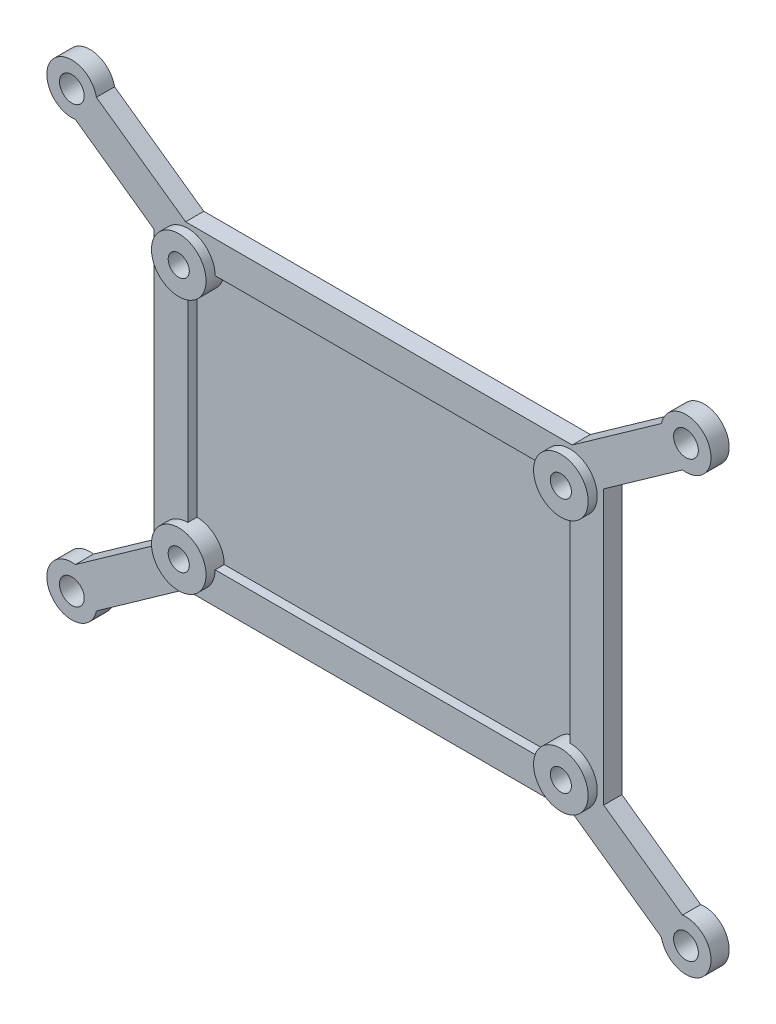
ISO-10303-21;
HEADER;
FILE_DESCRIPTION(('STEP AP214'),'2;1');
FILE_NAME('part.step','',(''),(''),'','','');
FILE_SCHEMA(('AUTOMOTIVE_DESIGN { 1 0 10303 214 1 1 1 1 }'));
ENDSEC;
DATA;
#1=APPLICATION_CONTEXT('core data for automotive mechanical design processes');
#2=APPLICATION_PROTOCOL_DEFINITION('international standard','automotive_design',2000,#1);
#3=PRODUCT_CONTEXT('',#1,'mechanical');
#4=PRODUCT('Part','Part','',(#3));
#5=PRODUCT_RELATED_PRODUCT_CATEGORY('part','',(#4));
#6=PRODUCT_DEFINITION_FORMATION('','',#4);
#7=PRODUCT_DEFINITION_CONTEXT('part definition',#1,'design');
#8=PRODUCT_DEFINITION('design','',#6,#7);
#9=PRODUCT_DEFINITION_SHAPE('','',#8);
#10=(LENGTH_UNIT() NAMED_UNIT(*) SI_UNIT(.MILLI.,.METRE.));
#11=(NAMED_UNIT(*) PLANE_ANGLE_UNIT() SI_UNIT($,.RADIAN.));
#12=(NAMED_UNIT(*) SI_UNIT($,.STERADIAN.) SOLID_ANGLE_UNIT());
#13=UNCERTAINTY_MEASURE_WITH_UNIT(LENGTH_MEASURE(1.E-05),#10,'distance_accuracy_value','');
#14=(GEOMETRIC_REPRESENTATION_CONTEXT(3) GLOBAL_UNCERTAINTY_ASSIGNED_CONTEXT((#13)) GLOBAL_UNIT_ASSIGNED_CONTEXT((#10,
#11,#12)) REPRESENTATION_CONTEXT('',''));
#15=CARTESIAN_POINT('',(0.,0.,0.));
#16=DIRECTION('',(0.,0.,1.));
#17=DIRECTION('',(1.,0.,0.));
#18=AXIS2_PLACEMENT_3D('',#15,#16,#17);
#19=CARTESIAN_POINT('',(-42.8625000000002,30.3625000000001,2.54));
#20=DIRECTION('',(0.,0.,1.));
#21=DIRECTION('',(1.,0.,0.));
#22=AXIS2_PLACEMENT_3D('',#19,#20,#21);
#23=PLANE('',#22);
#24=DIRECTION('',(-1.,0.,0.));
#25=VECTOR('',#24,1.);
#26=CARTESIAN_POINT('',(22.86,17.78,2.54));
#27=LINE('',#26,#25);
#28=CARTESIAN_POINT('',(22.86,17.78,2.54));
#29=VERTEX_POINT('',#28);
#30=CARTESIAN_POINT('',(-22.86,17.78,2.54));
#31=VERTEX_POINT('',#30);
#32=EDGE_CURVE('E393',#29,#31,#27,.T.);
#33=ORIENTED_EDGE('',*,*,#32,.F.);
#34=CARTESIAN_POINT('',(26.67,17.78,2.54));
#35=DIRECTION('',(0.,0.,1.));
#36=DIRECTION('',(1.,0.,0.));
#37=AXIS2_PLACEMENT_3D('',#34,#35,#36);
#38=CIRCLE('',#37,3.81);
#39=CARTESIAN_POINT('',(26.67,13.97,2.54));
#40=VERTEX_POINT('',#39);
#41=EDGE_CURVE('E356',#40,#29,#38,.T.);
#42=ORIENTED_EDGE('',*,*,#41,.F.);
#43=DIRECTION('',(0.,1.,0.));
#44=VECTOR('',#43,1.);
#45=CARTESIAN_POINT('',(26.67,-13.97,2.54));
#46=LINE('',#45,#44);
#47=CARTESIAN_POINT('',(26.67,-13.97,2.54));
#48=VERTEX_POINT('',#47);
#49=EDGE_CURVE('E50',#48,#40,#46,.T.);
#50=ORIENTED_EDGE('',*,*,#49,.F.);
#51=CARTESIAN_POINT('',(26.67,-17.78,2.54));
#52=DIRECTION('',(0.,0.,1.));
#53=DIRECTION('',(1.,0.,0.));
#54=AXIS2_PLACEMENT_3D('',#51,#52,#53);
#55=CIRCLE('',#54,3.81);
#56=CARTESIAN_POINT('',(22.86,-17.78,2.54));
#57=VERTEX_POINT('',#56);
#58=EDGE_CURVE('E350',#57,#48,#55,.T.);
#59=ORIENTED_EDGE('',*,*,#58,.F.);
#60=DIRECTION('',(1.,0.,0.));
#61=VECTOR('',#60,1.);
#62=CARTESIAN_POINT('',(22.86,-17.78,2.54));
#63=LINE('',#62,#61);
#64=CARTESIAN_POINT('',(-22.86,-17.78,2.54));
#65=VERTEX_POINT('',#64);
#66=EDGE_CURVE('E416',#65,#57,#63,.T.);
#67=ORIENTED_EDGE('',*,*,#66,.F.);
#68=CARTESIAN_POINT('',(-26.67,-17.78,2.54));
#69=DIRECTION('',(0.,0.,1.));
#70=DIRECTION('',(1.,0.,0.));
#71=AXIS2_PLACEMENT_3D('',#68,#69,#70);
#72=CIRCLE('',#71,3.81);
#73=CARTESIAN_POINT('',(-26.67,-13.97,2.54));
#74=VERTEX_POINT('',#73);
#75=EDGE_CURVE('E344',#74,#65,#72,.T.);
#76=ORIENTED_EDGE('',*,*,#75,.F.);
#77=DIRECTION('',(0.,-1.,0.));
#78=VECTOR('',#77,1.);
#79=CARTESIAN_POINT('',(-26.67,-13.97,2.54));
#80=LINE('',#79,#78);
#81=CARTESIAN_POINT('',(-26.67,13.97,2.54));
#82=VERTEX_POINT('',#81);
#83=EDGE_CURVE('E419',#82,#74,#80,.T.);
#84=ORIENTED_EDGE('',*,*,#83,.F.);
#85=CARTESIAN_POINT('',(-26.67,17.78,2.54));
#86=DIRECTION('',(0.,0.,1.));
#87=DIRECTION('',(1.,0.,0.));
#88=AXIS2_PLACEMENT_3D('',#85,#86,#87);
#89=CIRCLE('',#88,3.81);
#90=EDGE_CURVE('E338',#31,#82,#89,.T.);
#91=ORIENTED_EDGE('',*,*,#90,.F.);
#92=EDGE_LOOP('',(#33,#42,#50,#59,#67,#76,#84,#91));
#93=FACE_BOUND('',#92,.T.);
#94=CARTESIAN_POINT('',(-42.8625000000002,30.3625000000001,2.54));
#95=DIRECTION('',(0.,0.,1.));
#96=DIRECTION('',(1.,0.,0.));
#97=AXIS2_PLACEMENT_3D('',#94,#95,#96);
#98=CIRCLE('',#97,1.72719999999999);
#99=CARTESIAN_POINT('',(-41.1353000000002,30.3625000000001,2.54));
#100=VERTEX_POINT('',#99);
#101=EDGE_CURVE('E334',#100,#100,#98,.T.);
#102=ORIENTED_EDGE('',*,*,#101,.F.);
#103=EDGE_LOOP('',(#102));
#104=FACE_BOUND('',#103,.T.);
#105=CARTESIAN_POINT('',(42.8624999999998,30.3625000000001,2.54));
#106=DIRECTION('',(0.,0.,1.));
#107=DIRECTION('',(1.,0.,0.));
#108=AXIS2_PLACEMENT_3D('',#105,#106,#107);
#109=CIRCLE('',#108,1.72719999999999);
#110=CARTESIAN_POINT('',(44.5896999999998,30.3625000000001,2.54));
#111=VERTEX_POINT('',#110);
#112=EDGE_CURVE('E328',#111,#111,#109,.T.);
#113=ORIENTED_EDGE('',*,*,#112,.F.);
#114=EDGE_LOOP('',(#113));
#115=FACE_BOUND('',#114,.T.);
#116=CARTESIAN_POINT('',(-42.8625000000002,-30.3624999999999,2.54));
#117=DIRECTION('',(0.,0.,1.));
#118=DIRECTION('',(1.,0.,0.));
#119=AXIS2_PLACEMENT_3D('',#116,#117,#118);
#120=CIRCLE('',#119,1.72719999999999);
#121=CARTESIAN_POINT('',(-41.1353000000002,-30.3624999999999,2.54));
#122=VERTEX_POINT('',#121);
#123=EDGE_CURVE('E322',#122,#122,#120,.T.);
#124=ORIENTED_EDGE('',*,*,#123,.F.);
#125=EDGE_LOOP('',(#124));
#126=FACE_BOUND('',#125,.T.);
#127=CARTESIAN_POINT('',(42.8624999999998,-30.3624999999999,2.54));
#128=DIRECTION('',(0.,0.,1.));
#129=DIRECTION('',(1.,0.,0.));
#130=AXIS2_PLACEMENT_3D('',#127,#128,#129);
#131=CIRCLE('',#130,1.72719999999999);
#132=CARTESIAN_POINT('',(44.5896999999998,-30.3624999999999,2.54));
#133=VERTEX_POINT('',#132);
#134=EDGE_CURVE('E316',#133,#133,#131,.T.);
#135=ORIENTED_EDGE('',*,*,#134,.F.);
#136=EDGE_LOOP('',(#135));
#137=FACE_BOUND('',#136,.T.);
#138=CARTESIAN_POINT('',(-42.8625000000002,30.3625000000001,2.54));
#139=DIRECTION('',(0.,0.,1.));
#140=DIRECTION('',(1.,0.,0.));
#141=AXIS2_PLACEMENT_3D('',#138,#139,#140);
#142=CIRCLE('',#141,3.4925);
#143=CARTESIAN_POINT('',(-39.4382494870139,31.0495696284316,2.54));
#144=VERTEX_POINT('',#143);
#145=CARTESIAN_POINT('',(-42.374678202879,26.9042365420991,2.54));
#146=VERTEX_POINT('',#145);
#147=EDGE_CURVE('E223',#144,#146,#142,.T.);
#148=ORIENTED_EDGE('',*,*,#147,.T.);
#149=DIRECTION('',(0.816010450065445,-0.57803714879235,0.));
#150=VECTOR('',#149,1.);
#151=CARTESIAN_POINT('',(-42.374678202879,26.9042365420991,2.54));
#152=LINE('',#151,#150);
#153=CARTESIAN_POINT('',(-31.374855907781,19.1122947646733,2.54));
#154=VERTEX_POINT('',#153);
#155=EDGE_CURVE('E124',#146,#154,#152,.T.);
#156=ORIENTED_EDGE('',*,*,#155,.T.);
#157=DIRECTION('',(0.,-1.,0.));
#158=VECTOR('',#157,1.);
#159=CARTESIAN_POINT('',(-31.374855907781,-19.1122947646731,2.54));
#160=LINE('',#159,#158);
#161=CARTESIAN_POINT('',(-31.374855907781,-19.1122947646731,2.54));
#162=VERTEX_POINT('',#161);
#163=EDGE_CURVE('E262',#154,#162,#160,.T.);
#164=ORIENTED_EDGE('',*,*,#163,.T.);
#165=DIRECTION('',(-0.816010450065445,-0.57803714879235,0.));
#166=VECTOR('',#165,1.);
#167=CARTESIAN_POINT('',(-31.374855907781,-19.1122947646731,2.54));
#168=LINE('',#167,#166);
#169=CARTESIAN_POINT('',(-42.374678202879,-26.9042365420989,2.54));
#170=VERTEX_POINT('',#169);
#171=EDGE_CURVE('E280',#162,#170,#168,.T.);
#172=ORIENTED_EDGE('',*,*,#171,.T.);
#173=CARTESIAN_POINT('',(-42.8625000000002,-30.3624999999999,2.54));
#174=DIRECTION('',(0.,0.,1.));
#175=DIRECTION('',(1.,0.,0.));
#176=AXIS2_PLACEMENT_3D('',#173,#174,#175);
#177=CIRCLE('',#176,3.4925);
#178=CARTESIAN_POINT('',(-39.4382494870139,-31.0495696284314,2.54));
#179=VERTEX_POINT('',#178);
#180=EDGE_CURVE('E277',#170,#179,#177,.T.);
#181=ORIENTED_EDGE('',*,*,#180,.T.);
#182=DIRECTION('',(0.816010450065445,0.57803714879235,0.));
#183=VECTOR('',#182,1.);
#184=CARTESIAN_POINT('',(-26.9806746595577,-22.225,2.54));
#185=LINE('',#184,#183);
#186=CARTESIAN_POINT('',(-26.9806746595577,-22.225,2.54));
#187=VERTEX_POINT('',#186);
#188=EDGE_CURVE('E279',#179,#187,#185,.T.);
#189=ORIENTED_EDGE('',*,*,#188,.T.);
#190=DIRECTION('',(1.,0.,0.));
#191=VECTOR('',#190,1.);
#192=CARTESIAN_POINT('',(26.9806746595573,-22.225,2.54));
#193=LINE('',#192,#191);
#194=CARTESIAN_POINT('',(26.9806746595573,-22.225,2.54));
#195=VERTEX_POINT('',#194);
#196=EDGE_CURVE('E282',#187,#195,#193,.T.);
#197=ORIENTED_EDGE('',*,*,#196,.T.);
#198=DIRECTION('',(0.816010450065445,-0.57803714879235,0.));
#199=VECTOR('',#198,1.);
#200=CARTESIAN_POINT('',(26.9806746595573,-22.225,2.54));
#201=LINE('',#200,#199);
#202=CARTESIAN_POINT('',(39.4382494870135,-31.0495696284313,2.54));
#203=VERTEX_POINT('',#202);
#204=EDGE_CURVE('E288',#195,#203,#201,.T.);
#205=ORIENTED_EDGE('',*,*,#204,.T.);
#206=CARTESIAN_POINT('',(42.8624999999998,-30.3624999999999,2.54));
#207=DIRECTION('',(0.,0.,1.));
#208=DIRECTION('',(1.,0.,0.));
#209=AXIS2_PLACEMENT_3D('',#206,#207,#208);
#210=CIRCLE('',#209,3.4925);
#211=CARTESIAN_POINT('',(42.3746782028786,-26.9042365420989,2.54));
#212=VERTEX_POINT('',#211);
#213=EDGE_CURVE('E290',#203,#212,#210,.T.);
#214=ORIENTED_EDGE('',*,*,#213,.T.);
#215=DIRECTION('',(-0.816010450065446,0.57803714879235,0.));
#216=VECTOR('',#215,1.);
#217=CARTESIAN_POINT('',(31.374855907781,-19.1122947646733,2.54));
#218=LINE('',#217,#216);
#219=CARTESIAN_POINT('',(31.374855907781,-19.1122947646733,2.54));
#220=VERTEX_POINT('',#219);
#221=EDGE_CURVE('E292',#212,#220,#218,.T.);
#222=ORIENTED_EDGE('',*,*,#221,.T.);
#223=DIRECTION('',(0.,1.,0.));
#224=VECTOR('',#223,1.);
#225=CARTESIAN_POINT('',(31.374855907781,-19.1122947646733,2.54));
#226=LINE('',#225,#224);
#227=CARTESIAN_POINT('',(31.374855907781,19.1122947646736,2.54));
#228=VERTEX_POINT('',#227);
#229=EDGE_CURVE('E294',#220,#228,#226,.T.);
#230=ORIENTED_EDGE('',*,*,#229,.T.);
#231=DIRECTION('',(0.816010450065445,0.57803714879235,0.));
#232=VECTOR('',#231,1.);
#233=CARTESIAN_POINT('',(42.3746782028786,26.9042365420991,2.54));
#234=LINE('',#233,#232);
#235=CARTESIAN_POINT('',(42.3746782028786,26.9042365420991,2.54));
#236=VERTEX_POINT('',#235);
#237=EDGE_CURVE('E296',#228,#236,#234,.T.);
#238=ORIENTED_EDGE('',*,*,#237,.T.);
#239=CARTESIAN_POINT('',(42.8624999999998,30.3625000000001,2.54));
#240=DIRECTION('',(0.,0.,1.));
#241=DIRECTION('',(1.,0.,0.));
#242=AXIS2_PLACEMENT_3D('',#239,#240,#241);
#243=CIRCLE('',#242,3.4925);
#244=CARTESIAN_POINT('',(39.4382494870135,31.0495696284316,2.54));
#245=VERTEX_POINT('',#244);
#246=EDGE_CURVE('E170',#236,#245,#243,.T.);
#247=ORIENTED_EDGE('',*,*,#246,.T.);
#248=DIRECTION('',(-0.816010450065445,-0.57803714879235,0.));
#249=VECTOR('',#248,1.);
#250=CARTESIAN_POINT('',(39.4382494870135,31.0495696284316,2.54));
#251=LINE('',#250,#249);
#252=CARTESIAN_POINT('',(26.980674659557,22.225,2.54));
#253=VERTEX_POINT('',#252);
#254=EDGE_CURVE('E164',#245,#253,#251,.T.);
#255=ORIENTED_EDGE('',*,*,#254,.T.);
#256=DIRECTION('',(-1.,0.,0.));
#257=VECTOR('',#256,1.);
#258=CARTESIAN_POINT('',(26.980674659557,22.225,2.54));
#259=LINE('',#258,#257);
#260=CARTESIAN_POINT('',(-26.9806746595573,22.225,2.54));
#261=VERTEX_POINT('',#260);
#262=EDGE_CURVE('E167',#253,#261,#259,.T.);
#263=ORIENTED_EDGE('',*,*,#262,.T.);
#264=DIRECTION('',(-0.816010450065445,0.57803714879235,0.));
#265=VECTOR('',#264,1.);
#266=CARTESIAN_POINT('',(-39.4382494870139,31.0495696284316,2.54));
#267=LINE('',#266,#265);
#268=EDGE_CURVE('E59',#261,#144,#267,.T.);
#269=ORIENTED_EDGE('',*,*,#268,.T.);
#270=EDGE_LOOP('',(#148,#156,#164,#172,#181,#189,#197,#205,#214,#222,#230,#238,#247,#255,#263,#269));
#271=FACE_BOUND('',#270,.T.);
#272=ADVANCED_FACE('F35',(#93,#104,#115,#126,#137,#271),#23,.T.);
#273=CARTESIAN_POINT('',(-42.8625000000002,30.3625000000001,2.54));
#274=DIRECTION('',(0.,0.,-1.));
#275=DIRECTION('',(-1.,0.,0.));
#276=AXIS2_PLACEMENT_3D('',#273,#274,#275);
#277=CYLINDRICAL_SURFACE('',#276,3.4925);
#278=CARTESIAN_POINT('',(-42.8625000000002,30.3625000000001,0.));
#279=DIRECTION('',(0.,0.,1.));
#280=DIRECTION('',(1.,0.,0.));
#281=AXIS2_PLACEMENT_3D('',#278,#279,#280);
#282=CIRCLE('',#281,3.4925);
#283=CARTESIAN_POINT('',(-39.4382494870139,31.0495696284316,0.));
#284=VERTEX_POINT('',#283);
#285=CARTESIAN_POINT('',(-42.374678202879,26.9042365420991,0.));
#286=VERTEX_POINT('',#285);
#287=EDGE_CURVE('E191',#284,#286,#282,.T.);
#288=ORIENTED_EDGE('',*,*,#287,.T.);
#289=DIRECTION('',(0.,0.,-1.));
#290=VECTOR('',#289,1.);
#291=CARTESIAN_POINT('',(-42.374678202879,26.9042365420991,2.54));
#292=LINE('',#291,#290);
#293=EDGE_CURVE('E12',#146,#286,#292,.T.);
#294=ORIENTED_EDGE('',*,*,#293,.F.);
#295=ORIENTED_EDGE('',*,*,#147,.F.);
#296=DIRECTION('',(0.,0.,-1.));
#297=VECTOR('',#296,1.);
#298=CARTESIAN_POINT('',(-39.4382494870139,31.0495696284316,2.54));
#299=LINE('',#298,#297);
#300=EDGE_CURVE('E187',#144,#284,#299,.T.);
#301=ORIENTED_EDGE('',*,*,#300,.T.);
#302=EDGE_LOOP('',(#288,#294,#295,#301));
#303=FACE_BOUND('',#302,.T.);
#304=ADVANCED_FACE('F37',(#303),#277,.T.);
#305=CARTESIAN_POINT('',(-42.374678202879,26.9042365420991,2.54));
#306=DIRECTION('',(0.57803714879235,0.816010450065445,0.));
#307=DIRECTION('',(-0.816010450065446,0.57803714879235,0.));
#308=AXIS2_PLACEMENT_3D('',#305,#306,#307);
#309=PLANE('',#308);
#310=DIRECTION('',(0.816010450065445,-0.57803714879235,0.));
#311=VECTOR('',#310,1.);
#312=CARTESIAN_POINT('',(-42.374678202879,26.9042365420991,0.));
#313=LINE('',#312,#311);
#314=CARTESIAN_POINT('',(-31.374855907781,19.1122947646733,0.));
#315=VERTEX_POINT('',#314);
#316=EDGE_CURVE('E194',#286,#315,#313,.T.);
#317=ORIENTED_EDGE('',*,*,#316,.T.);
#318=DIRECTION('',(0.,0.,-1.));
#319=VECTOR('',#318,1.);
#320=CARTESIAN_POINT('',(-31.374855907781,19.1122947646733,2.54));
#321=LINE('',#320,#319);
#322=EDGE_CURVE('E43',#154,#315,#321,.T.);
#323=ORIENTED_EDGE('',*,*,#322,.F.);
#324=ORIENTED_EDGE('',*,*,#155,.F.);
#325=ORIENTED_EDGE('',*,*,#293,.T.);
#326=EDGE_LOOP('',(#317,#323,#324,#325));
#327=FACE_BOUND('',#326,.T.);
#328=ADVANCED_FACE('F524',(#327),#309,.F.);
#329=CARTESIAN_POINT('',(-31.374855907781,-19.1122947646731,2.54));
#330=DIRECTION('',(1.,0.,0.));
#331=DIRECTION('',(0.,0.,-1.));
#332=AXIS2_PLACEMENT_3D('',#329,#330,#331);
#333=PLANE('',#332);
#334=DIRECTION('',(0.,-1.,0.));
#335=VECTOR('',#334,1.);
#336=CARTESIAN_POINT('',(-31.374855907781,-19.1122947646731,0.));
#337=LINE('',#336,#335);
#338=CARTESIAN_POINT('',(-31.374855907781,-19.1122947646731,0.));
#339=VERTEX_POINT('',#338);
#340=EDGE_CURVE('E197',#315,#339,#337,.T.);
#341=ORIENTED_EDGE('',*,*,#340,.T.);
#342=DIRECTION('',(0.,0.,-1.));
#343=VECTOR('',#342,1.);
#344=CARTESIAN_POINT('',(-31.374855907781,-19.1122947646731,2.54));
#345=LINE('',#344,#343);
#346=EDGE_CURVE('E254',#162,#339,#345,.T.);
#347=ORIENTED_EDGE('',*,*,#346,.F.);
#348=ORIENTED_EDGE('',*,*,#163,.F.);
#349=ORIENTED_EDGE('',*,*,#322,.T.);
#350=EDGE_LOOP('',(#341,#347,#348,#349));
#351=FACE_BOUND('',#350,.T.);
#352=ADVANCED_FACE('F260',(#351),#333,.F.);
#353=CARTESIAN_POINT('',(-31.374855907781,-19.1122947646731,2.54));
#354=DIRECTION('',(0.57803714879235,-0.816010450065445,0.));
#355=DIRECTION('',(0.816010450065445,0.57803714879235,0.));
#356=AXIS2_PLACEMENT_3D('',#353,#354,#355);
#357=PLANE('',#356);
#358=DIRECTION('',(-0.816010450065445,-0.57803714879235,0.));
#359=VECTOR('',#358,1.);
#360=CARTESIAN_POINT('',(-31.374855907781,-19.1122947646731,0.));
#361=LINE('',#360,#359);
#362=CARTESIAN_POINT('',(-42.374678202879,-26.9042365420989,0.));
#363=VERTEX_POINT('',#362);
#364=EDGE_CURVE('E199',#339,#363,#361,.T.);
#365=ORIENTED_EDGE('',*,*,#364,.T.);
#366=DIRECTION('',(0.,0.,-1.));
#367=VECTOR('',#366,1.);
#368=CARTESIAN_POINT('',(-42.374678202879,-26.9042365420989,2.54));
#369=LINE('',#368,#367);
#370=EDGE_CURVE('E251',#170,#363,#369,.T.);
#371=ORIENTED_EDGE('',*,*,#370,.F.);
#372=ORIENTED_EDGE('',*,*,#171,.F.);
#373=ORIENTED_EDGE('',*,*,#346,.T.);
#374=EDGE_LOOP('',(#365,#371,#372,#373));
#375=FACE_BOUND('',#374,.T.);
#376=ADVANCED_FACE('F271',(#375),#357,.F.);
#377=CARTESIAN_POINT('',(-42.8625000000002,-30.3624999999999,2.54));
#378=DIRECTION('',(0.,0.,-1.));
#379=DIRECTION('',(-1.,0.,0.));
#380=AXIS2_PLACEMENT_3D('',#377,#378,#379);
#381=CYLINDRICAL_SURFACE('',#380,3.4925);
#382=CARTESIAN_POINT('',(-42.8625000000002,-30.3624999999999,0.));
#383=DIRECTION('',(0.,0.,1.));
#384=DIRECTION('',(1.,0.,0.));
#385=AXIS2_PLACEMENT_3D('',#382,#383,#384);
#386=CIRCLE('',#385,3.4925);
#387=CARTESIAN_POINT('',(-39.4382494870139,-31.0495696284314,0.));
#388=VERTEX_POINT('',#387);
#389=EDGE_CURVE('E201',#363,#388,#386,.T.);
#390=ORIENTED_EDGE('',*,*,#389,.T.);
#391=DIRECTION('',(0.,0.,-1.));
#392=VECTOR('',#391,1.);
#393=CARTESIAN_POINT('',(-39.4382494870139,-31.0495696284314,2.54));
#394=LINE('',#393,#392);
#395=EDGE_CURVE('E248',#179,#388,#394,.T.);
#396=ORIENTED_EDGE('',*,*,#395,.F.);
#397=ORIENTED_EDGE('',*,*,#180,.F.);
#398=ORIENTED_EDGE('',*,*,#370,.T.);
#399=EDGE_LOOP('',(#390,#396,#397,#398));
#400=FACE_BOUND('',#399,.T.);
#401=ADVANCED_FACE('F275',(#400),#381,.T.);
#402=CARTESIAN_POINT('',(-26.9806746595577,-22.225,2.54));
#403=DIRECTION('',(-0.57803714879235,0.816010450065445,0.));
#404=DIRECTION('',(-0.816010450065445,-0.57803714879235,0.));
#405=AXIS2_PLACEMENT_3D('',#402,#403,#404);
#406=PLANE('',#405);
#407=DIRECTION('',(0.816010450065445,0.57803714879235,0.));
#408=VECTOR('',#407,1.);
#409=CARTESIAN_POINT('',(-26.9806746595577,-22.225,0.));
#410=LINE('',#409,#408);
#411=CARTESIAN_POINT('',(-26.9806746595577,-22.225,0.));
#412=VERTEX_POINT('',#411);
#413=EDGE_CURVE('E203',#388,#412,#410,.T.);
#414=ORIENTED_EDGE('',*,*,#413,.T.);
#415=DIRECTION('',(0.,0.,-1.));
#416=VECTOR('',#415,1.);
#417=CARTESIAN_POINT('',(-26.9806746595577,-22.225,2.54));
#418=LINE('',#417,#416);
#419=EDGE_CURVE('E245',#187,#412,#418,.T.);
#420=ORIENTED_EDGE('',*,*,#419,.F.);
#421=ORIENTED_EDGE('',*,*,#188,.F.);
#422=ORIENTED_EDGE('',*,*,#395,.T.);
#423=EDGE_LOOP('',(#414,#420,#421,#422));
#424=FACE_BOUND('',#423,.T.);
#425=ADVANCED_FACE('F561',(#424),#406,.F.);
#426=CARTESIAN_POINT('',(26.9806746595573,-22.225,2.54));
#427=DIRECTION('',(0.,1.,0.));
#428=DIRECTION('',(0.,0.,1.));
#429=AXIS2_PLACEMENT_3D('',#426,#427,#428);
#430=PLANE('',#429);
#431=DIRECTION('',(1.,0.,0.));
#432=VECTOR('',#431,1.);
#433=CARTESIAN_POINT('',(26.9806746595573,-22.225,0.));
#434=LINE('',#433,#432);
#435=CARTESIAN_POINT('',(26.9806746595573,-22.225,0.));
#436=VERTEX_POINT('',#435);
#437=EDGE_CURVE('E205',#412,#436,#434,.T.);
#438=ORIENTED_EDGE('',*,*,#437,.T.);
#439=DIRECTION('',(0.,0.,-1.));
#440=VECTOR('',#439,1.);
#441=CARTESIAN_POINT('',(26.9806746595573,-22.225,2.54));
#442=LINE('',#441,#440);
#443=EDGE_CURVE('E242',#195,#436,#442,.T.);
#444=ORIENTED_EDGE('',*,*,#443,.F.);
#445=ORIENTED_EDGE('',*,*,#196,.F.);
#446=ORIENTED_EDGE('',*,*,#419,.T.);
#447=EDGE_LOOP('',(#438,#444,#445,#446));
#448=FACE_BOUND('',#447,.T.);
#449=ADVANCED_FACE('F557',(#448),#430,.F.);
#450=CARTESIAN_POINT('',(26.9806746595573,-22.225,2.54));
#451=DIRECTION('',(0.57803714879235,0.816010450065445,0.));
#452=DIRECTION('',(-0.816010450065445,0.57803714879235,0.));
#453=AXIS2_PLACEMENT_3D('',#450,#451,#452);
#454=PLANE('',#453);
#455=DIRECTION('',(0.816010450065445,-0.57803714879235,0.));
#456=VECTOR('',#455,1.);
#457=CARTESIAN_POINT('',(26.9806746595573,-22.225,0.));
#458=LINE('',#457,#456);
#459=CARTESIAN_POINT('',(39.4382494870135,-31.0495696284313,0.));
#460=VERTEX_POINT('',#459);
#461=EDGE_CURVE('E207',#436,#460,#458,.T.);
#462=ORIENTED_EDGE('',*,*,#461,.T.);
#463=DIRECTION('',(0.,0.,-1.));
#464=VECTOR('',#463,1.);
#465=CARTESIAN_POINT('',(39.4382494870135,-31.0495696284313,2.54));
#466=LINE('',#465,#464);
#467=EDGE_CURVE('E239',#203,#460,#466,.T.);
#468=ORIENTED_EDGE('',*,*,#467,.F.);
#469=ORIENTED_EDGE('',*,*,#204,.F.);
#470=ORIENTED_EDGE('',*,*,#443,.T.);
#471=EDGE_LOOP('',(#462,#468,#469,#470));
#472=FACE_BOUND('',#471,.T.);
#473=ADVANCED_FACE('F553',(#472),#454,.F.);
#474=CARTESIAN_POINT('',(42.8624999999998,-30.3624999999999,2.54));
#475=DIRECTION('',(0.,0.,-1.));
#476=DIRECTION('',(-1.,0.,0.));
#477=AXIS2_PLACEMENT_3D('',#474,#475,#476);
#478=CYLINDRICAL_SURFACE('',#477,3.4925);
#479=CARTESIAN_POINT('',(42.8624999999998,-30.3624999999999,0.));
#480=DIRECTION('',(0.,0.,1.));
#481=DIRECTION('',(1.,0.,0.));
#482=AXIS2_PLACEMENT_3D('',#479,#480,#481);
#483=CIRCLE('',#482,3.4925);
#484=CARTESIAN_POINT('',(42.3746782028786,-26.9042365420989,0.));
#485=VERTEX_POINT('',#484);
#486=EDGE_CURVE('E209',#460,#485,#483,.T.);
#487=ORIENTED_EDGE('',*,*,#486,.T.);
#488=DIRECTION('',(0.,0.,-1.));
#489=VECTOR('',#488,1.);
#490=CARTESIAN_POINT('',(42.3746782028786,-26.9042365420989,2.54));
#491=LINE('',#490,#489);
#492=EDGE_CURVE('E236',#212,#485,#491,.T.);
#493=ORIENTED_EDGE('',*,*,#492,.F.);
#494=ORIENTED_EDGE('',*,*,#213,.F.);
#495=ORIENTED_EDGE('',*,*,#467,.T.);
#496=EDGE_LOOP('',(#487,#493,#494,#495));
#497=FACE_BOUND('',#496,.T.);
#498=ADVANCED_FACE('F549',(#497),#478,.T.);
#499=CARTESIAN_POINT('',(31.374855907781,-19.1122947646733,2.54));
#500=DIRECTION('',(-0.57803714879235,-0.816010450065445,0.));
#501=DIRECTION('',(0.816010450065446,-0.57803714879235,0.));
#502=AXIS2_PLACEMENT_3D('',#499,#500,#501);
#503=PLANE('',#502);
#504=DIRECTION('',(-0.816010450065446,0.57803714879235,0.));
#505=VECTOR('',#504,1.);
#506=CARTESIAN_POINT('',(31.374855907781,-19.1122947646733,0.));
#507=LINE('',#506,#505);
#508=CARTESIAN_POINT('',(31.374855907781,-19.1122947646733,0.));
#509=VERTEX_POINT('',#508);
#510=EDGE_CURVE('E211',#485,#509,#507,.T.);
#511=ORIENTED_EDGE('',*,*,#510,.T.);
#512=DIRECTION('',(0.,0.,-1.));
#513=VECTOR('',#512,1.);
#514=CARTESIAN_POINT('',(31.374855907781,-19.1122947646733,2.54));
#515=LINE('',#514,#513);
#516=EDGE_CURVE('E233',#220,#509,#515,.T.);
#517=ORIENTED_EDGE('',*,*,#516,.F.);
#518=ORIENTED_EDGE('',*,*,#221,.F.);
#519=ORIENTED_EDGE('',*,*,#492,.T.);
#520=EDGE_LOOP('',(#511,#517,#518,#519));
#521=FACE_BOUND('',#520,.T.);
#522=ADVANCED_FACE('F545',(#521),#503,.F.);
#523=CARTESIAN_POINT('',(31.374855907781,-19.1122947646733,2.54));
#524=DIRECTION('',(-1.,0.,0.));
#525=DIRECTION('',(0.,0.,1.));
#526=AXIS2_PLACEMENT_3D('',#523,#524,#525);
#527=PLANE('',#526);
#528=DIRECTION('',(0.,1.,0.));
#529=VECTOR('',#528,1.);
#530=CARTESIAN_POINT('',(31.374855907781,-19.1122947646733,0.));
#531=LINE('',#530,#529);
#532=CARTESIAN_POINT('',(31.374855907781,19.1122947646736,0.));
#533=VERTEX_POINT('',#532);
#534=EDGE_CURVE('E213',#509,#533,#531,.T.);
#535=ORIENTED_EDGE('',*,*,#534,.T.);
#536=DIRECTION('',(0.,0.,-1.));
#537=VECTOR('',#536,1.);
#538=CARTESIAN_POINT('',(31.374855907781,19.1122947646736,2.54));
#539=LINE('',#538,#537);
#540=EDGE_CURVE('E230',#228,#533,#539,.T.);
#541=ORIENTED_EDGE('',*,*,#540,.F.);
#542=ORIENTED_EDGE('',*,*,#229,.F.);
#543=ORIENTED_EDGE('',*,*,#516,.T.);
#544=EDGE_LOOP('',(#535,#541,#542,#543));
#545=FACE_BOUND('',#544,.T.);
#546=ADVANCED_FACE('F542',(#545),#527,.F.);
#547=CARTESIAN_POINT('',(42.3746782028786,26.9042365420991,2.54));
#548=DIRECTION('',(-0.57803714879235,0.816010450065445,0.));
#549=DIRECTION('',(-0.816010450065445,-0.57803714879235,0.));
#550=AXIS2_PLACEMENT_3D('',#547,#548,#549);
#551=PLANE('',#550);
#552=DIRECTION('',(0.816010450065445,0.57803714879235,0.));
#553=VECTOR('',#552,1.);
#554=CARTESIAN_POINT('',(42.3746782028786,26.9042365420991,0.));
#555=LINE('',#554,#553);
#556=CARTESIAN_POINT('',(42.3746782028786,26.9042365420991,0.));
#557=VERTEX_POINT('',#556);
#558=EDGE_CURVE('E215',#533,#557,#555,.T.);
#559=ORIENTED_EDGE('',*,*,#558,.T.);
#560=DIRECTION('',(0.,0.,-1.));
#561=VECTOR('',#560,1.);
#562=CARTESIAN_POINT('',(42.3746782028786,26.9042365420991,2.54));
#563=LINE('',#562,#561);
#564=EDGE_CURVE('E227',#236,#557,#563,.T.);
#565=ORIENTED_EDGE('',*,*,#564,.F.);
#566=ORIENTED_EDGE('',*,*,#237,.F.);
#567=ORIENTED_EDGE('',*,*,#540,.T.);
#568=EDGE_LOOP('',(#559,#565,#566,#567));
#569=FACE_BOUND('',#568,.T.);
#570=ADVANCED_FACE('F302',(#569),#551,.F.);
#571=CARTESIAN_POINT('',(42.8624999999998,30.3625000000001,2.54));
#572=DIRECTION('',(0.,0.,-1.));
#573=DIRECTION('',(-1.,0.,0.));
#574=AXIS2_PLACEMENT_3D('',#571,#572,#573);
#575=CYLINDRICAL_SURFACE('',#574,3.4925);
#576=CARTESIAN_POINT('',(42.8624999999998,30.3625000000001,0.));
#577=DIRECTION('',(0.,0.,1.));
#578=DIRECTION('',(1.,0.,0.));
#579=AXIS2_PLACEMENT_3D('',#576,#577,#578);
#580=CIRCLE('',#579,3.4925);
#581=CARTESIAN_POINT('',(39.4382494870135,31.0495696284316,0.));
#582=VERTEX_POINT('',#581);
#583=EDGE_CURVE('E217',#557,#582,#580,.T.);
#584=ORIENTED_EDGE('',*,*,#583,.T.);
#585=DIRECTION('',(0.,0.,-1.));
#586=VECTOR('',#585,1.);
#587=CARTESIAN_POINT('',(39.4382494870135,31.0495696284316,2.54));
#588=LINE('',#587,#586);
#589=EDGE_CURVE('E182',#245,#582,#588,.T.);
#590=ORIENTED_EDGE('',*,*,#589,.F.);
#591=ORIENTED_EDGE('',*,*,#246,.F.);
#592=ORIENTED_EDGE('',*,*,#564,.T.);
#593=EDGE_LOOP('',(#584,#590,#591,#592));
#594=FACE_BOUND('',#593,.T.);
#595=ADVANCED_FACE('F306',(#594),#575,.T.);
#596=CARTESIAN_POINT('',(39.4382494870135,31.0495696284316,2.54));
#597=DIRECTION('',(0.57803714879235,-0.816010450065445,0.));
#598=DIRECTION('',(0.816010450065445,0.57803714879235,0.));
#599=AXIS2_PLACEMENT_3D('',#596,#597,#598);
#600=PLANE('',#599);
#601=DIRECTION('',(-0.816010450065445,-0.57803714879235,0.));
#602=VECTOR('',#601,1.);
#603=CARTESIAN_POINT('',(39.4382494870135,31.0495696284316,0.));
#604=LINE('',#603,#602);
#605=CARTESIAN_POINT('',(26.980674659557,22.225,0.));
#606=VERTEX_POINT('',#605);
#607=EDGE_CURVE('E179',#582,#606,#604,.T.);
#608=ORIENTED_EDGE('',*,*,#607,.T.);
#609=DIRECTION('',(0.,0.,-1.));
#610=VECTOR('',#609,1.);
#611=CARTESIAN_POINT('',(26.980674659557,22.225,2.54));
#612=LINE('',#611,#610);
#613=EDGE_CURVE('E176',#253,#606,#612,.T.);
#614=ORIENTED_EDGE('',*,*,#613,.F.);
#615=ORIENTED_EDGE('',*,*,#254,.F.);
#616=ORIENTED_EDGE('',*,*,#589,.T.);
#617=EDGE_LOOP('',(#608,#614,#615,#616));
#618=FACE_BOUND('',#617,.T.);
#619=ADVANCED_FACE('F177',(#618),#600,.F.);
#620=CARTESIAN_POINT('',(26.980674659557,22.225,2.54));
#621=DIRECTION('',(0.,-1.,0.));
#622=DIRECTION('',(0.,0.,-1.));
#623=AXIS2_PLACEMENT_3D('',#620,#621,#622);
#624=PLANE('',#623);
#625=DIRECTION('',(-1.,0.,0.));
#626=VECTOR('',#625,1.);
#627=CARTESIAN_POINT('',(26.980674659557,22.225,0.));
#628=LINE('',#627,#626);
#629=CARTESIAN_POINT('',(-26.9806746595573,22.225,0.));
#630=VERTEX_POINT('',#629);
#631=EDGE_CURVE('E220',#606,#630,#628,.T.);
#632=ORIENTED_EDGE('',*,*,#631,.T.);
#633=DIRECTION('',(0.,0.,-1.));
#634=VECTOR('',#633,1.);
#635=CARTESIAN_POINT('',(-26.9806746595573,22.225,2.54));
#636=LINE('',#635,#634);
#637=EDGE_CURVE('E183',#261,#630,#636,.T.);
#638=ORIENTED_EDGE('',*,*,#637,.F.);
#639=ORIENTED_EDGE('',*,*,#262,.F.);
#640=ORIENTED_EDGE('',*,*,#613,.T.);
#641=EDGE_LOOP('',(#632,#638,#639,#640));
#642=FACE_BOUND('',#641,.T.);
#643=ADVANCED_FACE('F185',(#642),#624,.F.);
#644=CARTESIAN_POINT('',(-39.4382494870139,31.0495696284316,2.54));
#645=DIRECTION('',(-0.57803714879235,-0.816010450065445,0.));
#646=DIRECTION('',(0.816010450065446,-0.57803714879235,0.));
#647=AXIS2_PLACEMENT_3D('',#644,#645,#646);
#648=PLANE('',#647);
#649=DIRECTION('',(-0.816010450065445,0.57803714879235,0.));
#650=VECTOR('',#649,1.);
#651=CARTESIAN_POINT('',(-39.4382494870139,31.0495696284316,0.));
#652=LINE('',#651,#650);
#653=EDGE_CURVE('E116',#630,#284,#652,.T.);
#654=ORIENTED_EDGE('',*,*,#653,.T.);
#655=ORIENTED_EDGE('',*,*,#300,.F.);
#656=ORIENTED_EDGE('',*,*,#268,.F.);
#657=ORIENTED_EDGE('',*,*,#637,.T.);
#658=EDGE_LOOP('',(#654,#655,#656,#657));
#659=FACE_BOUND('',#658,.T.);
#660=ADVANCED_FACE('F307',(#659),#648,.F.);
#661=CARTESIAN_POINT('',(-42.8625000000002,30.3625000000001,0.));
#662=DIRECTION('',(0.,0.,1.));
#663=DIRECTION('',(1.,0.,0.));
#664=AXIS2_PLACEMENT_3D('',#661,#662,#663);
#665=PLANE('',#664);
#666=CARTESIAN_POINT('',(-26.67,17.78,0.));
#667=DIRECTION('',(0.,0.,1.));
#668=DIRECTION('',(1.,0.,0.));
#669=AXIS2_PLACEMENT_3D('',#666,#667,#668);
#670=CIRCLE('',#669,1.4732);
#671=CARTESIAN_POINT('',(-25.1968,17.78,0.));
#672=VERTEX_POINT('',#671);
#673=EDGE_CURVE('E379',#672,#672,#670,.T.);
#674=ORIENTED_EDGE('',*,*,#673,.T.);
#675=EDGE_LOOP('',(#674));
#676=FACE_BOUND('',#675,.T.);
#677=CARTESIAN_POINT('',(-26.67,-17.78,0.));
#678=DIRECTION('',(0.,0.,1.));
#679=DIRECTION('',(1.,0.,0.));
#680=AXIS2_PLACEMENT_3D('',#677,#678,#679);
#681=CIRCLE('',#680,1.4732);
#682=CARTESIAN_POINT('',(-25.1968,-17.78,0.));
#683=VERTEX_POINT('',#682);
#684=EDGE_CURVE('E373',#683,#683,#681,.T.);
#685=ORIENTED_EDGE('',*,*,#684,.T.);
#686=EDGE_LOOP('',(#685));
#687=FACE_BOUND('',#686,.T.);
#688=CARTESIAN_POINT('',(26.67,17.78,0.));
#689=DIRECTION('',(0.,0.,1.));
#690=DIRECTION('',(1.,0.,0.));
#691=AXIS2_PLACEMENT_3D('',#688,#689,#690);
#692=CIRCLE('',#691,1.4732);
#693=CARTESIAN_POINT('',(28.1432,17.78,0.));
#694=VERTEX_POINT('',#693);
#695=EDGE_CURVE('E367',#694,#694,#692,.T.);
#696=ORIENTED_EDGE('',*,*,#695,.T.);
#697=EDGE_LOOP('',(#696));
#698=FACE_BOUND('',#697,.T.);
#699=CARTESIAN_POINT('',(26.67,-17.78,0.));
#700=DIRECTION('',(0.,0.,1.));
#701=DIRECTION('',(1.,0.,0.));
#702=AXIS2_PLACEMENT_3D('',#699,#700,#701);
#703=CIRCLE('',#702,1.4732);
#704=CARTESIAN_POINT('',(28.1432,-17.78,0.));
#705=VERTEX_POINT('',#704);
#706=EDGE_CURVE('E359',#705,#705,#703,.T.);
#707=ORIENTED_EDGE('',*,*,#706,.T.);
#708=EDGE_LOOP('',(#707));
#709=FACE_BOUND('',#708,.T.);
#710=CARTESIAN_POINT('',(-42.8625000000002,30.3625000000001,0.));
#711=DIRECTION('',(0.,0.,1.));
#712=DIRECTION('',(1.,0.,0.));
#713=AXIS2_PLACEMENT_3D('',#710,#711,#712);
#714=CIRCLE('',#713,1.72719999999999);
#715=CARTESIAN_POINT('',(-41.1353000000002,30.3625000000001,0.));
#716=VERTEX_POINT('',#715);
#717=EDGE_CURVE('E331',#716,#716,#714,.T.);
#718=ORIENTED_EDGE('',*,*,#717,.T.);
#719=EDGE_LOOP('',(#718));
#720=FACE_BOUND('',#719,.T.);
#721=CARTESIAN_POINT('',(42.8624999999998,30.3625000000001,0.));
#722=DIRECTION('',(0.,0.,1.));
#723=DIRECTION('',(1.,0.,0.));
#724=AXIS2_PLACEMENT_3D('',#721,#722,#723);
#725=CIRCLE('',#724,1.72719999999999);
#726=CARTESIAN_POINT('',(44.5896999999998,30.3625000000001,0.));
#727=VERTEX_POINT('',#726);
#728=EDGE_CURVE('E325',#727,#727,#725,.T.);
#729=ORIENTED_EDGE('',*,*,#728,.T.);
#730=EDGE_LOOP('',(#729));
#731=FACE_BOUND('',#730,.T.);
#732=CARTESIAN_POINT('',(-42.8625000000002,-30.3624999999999,0.));
#733=DIRECTION('',(0.,0.,1.));
#734=DIRECTION('',(1.,0.,0.));
#735=AXIS2_PLACEMENT_3D('',#732,#733,#734);
#736=CIRCLE('',#735,1.72719999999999);
#737=CARTESIAN_POINT('',(-41.1353000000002,-30.3624999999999,0.));
#738=VERTEX_POINT('',#737);
#739=EDGE_CURVE('E319',#738,#738,#736,.T.);
#740=ORIENTED_EDGE('',*,*,#739,.T.);
#741=EDGE_LOOP('',(#740));
#742=FACE_BOUND('',#741,.T.);
#743=CARTESIAN_POINT('',(42.8624999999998,-30.3624999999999,0.));
#744=DIRECTION('',(0.,0.,1.));
#745=DIRECTION('',(1.,0.,0.));
#746=AXIS2_PLACEMENT_3D('',#743,#744,#745);
#747=CIRCLE('',#746,1.72719999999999);
#748=CARTESIAN_POINT('',(44.5896999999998,-30.3624999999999,0.));
#749=VERTEX_POINT('',#748);
#750=EDGE_CURVE('E195',#749,#749,#747,.T.);
#751=ORIENTED_EDGE('',*,*,#750,.T.);
#752=EDGE_LOOP('',(#751));
#753=FACE_BOUND('',#752,.T.);
#754=ORIENTED_EDGE('',*,*,#287,.F.);
#755=ORIENTED_EDGE('',*,*,#653,.F.);
#756=ORIENTED_EDGE('',*,*,#631,.F.);
#757=ORIENTED_EDGE('',*,*,#607,.F.);
#758=ORIENTED_EDGE('',*,*,#583,.F.);
#759=ORIENTED_EDGE('',*,*,#558,.F.);
#760=ORIENTED_EDGE('',*,*,#534,.F.);
#761=ORIENTED_EDGE('',*,*,#510,.F.);
#762=ORIENTED_EDGE('',*,*,#486,.F.);
#763=ORIENTED_EDGE('',*,*,#461,.F.);
#764=ORIENTED_EDGE('',*,*,#437,.F.);
#765=ORIENTED_EDGE('',*,*,#413,.F.);
#766=ORIENTED_EDGE('',*,*,#389,.F.);
#767=ORIENTED_EDGE('',*,*,#364,.F.);
#768=ORIENTED_EDGE('',*,*,#340,.F.);
#769=ORIENTED_EDGE('',*,*,#316,.F.);
#770=EDGE_LOOP('',(#754,#755,#756,#757,#758,#759,#760,#761,#762,#763,#764,#765,#766,#767,#768,#769));
#771=FACE_BOUND('',#770,.T.);
#772=ADVANCED_FACE('F266',(#676,#687,#698,#709,#720,#731,#742,#753,#771),#665,.F.);
#773=CARTESIAN_POINT('',(42.8624999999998,-30.3624999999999,2.54));
#774=DIRECTION('',(0.,0.,1.));
#775=DIRECTION('',(1.,0.,0.));
#776=AXIS2_PLACEMENT_3D('',#773,#774,#775);
#777=CYLINDRICAL_SURFACE('',#776,1.72719999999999);
#778=ORIENTED_EDGE('',*,*,#134,.T.);
#779=EDGE_LOOP('',(#778));
#780=FACE_BOUND('',#779,.T.);
#781=ORIENTED_EDGE('',*,*,#750,.F.);
#782=EDGE_LOOP('',(#781));
#783=FACE_BOUND('',#782,.T.);
#784=ADVANCED_FACE('F527',(#780,#783),#777,.F.);
#785=CARTESIAN_POINT('',(-42.8625000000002,-30.3624999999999,2.54));
#786=DIRECTION('',(0.,0.,1.));
#787=DIRECTION('',(1.,0.,0.));
#788=AXIS2_PLACEMENT_3D('',#785,#786,#787);
#789=CYLINDRICAL_SURFACE('',#788,1.72719999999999);
#790=ORIENTED_EDGE('',*,*,#123,.T.);
#791=EDGE_LOOP('',(#790));
#792=FACE_BOUND('',#791,.T.);
#793=ORIENTED_EDGE('',*,*,#739,.F.);
#794=EDGE_LOOP('',(#793));
#795=FACE_BOUND('',#794,.T.);
#796=ADVANCED_FACE('F644',(#792,#795),#789,.F.);
#797=CARTESIAN_POINT('',(42.8624999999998,30.3625000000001,2.54));
#798=DIRECTION('',(0.,0.,1.));
#799=DIRECTION('',(1.,0.,0.));
#800=AXIS2_PLACEMENT_3D('',#797,#798,#799);
#801=CYLINDRICAL_SURFACE('',#800,1.72719999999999);
#802=ORIENTED_EDGE('',*,*,#112,.T.);
#803=EDGE_LOOP('',(#802));
#804=FACE_BOUND('',#803,.T.);
#805=ORIENTED_EDGE('',*,*,#728,.F.);
#806=EDGE_LOOP('',(#805));
#807=FACE_BOUND('',#806,.T.);
#808=ADVANCED_FACE('F651',(#804,#807),#801,.F.);
#809=CARTESIAN_POINT('',(-42.8625000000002,30.3625000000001,2.54));
#810=DIRECTION('',(0.,0.,1.));
#811=DIRECTION('',(1.,0.,0.));
#812=AXIS2_PLACEMENT_3D('',#809,#810,#811);
#813=CYLINDRICAL_SURFACE('',#812,1.72719999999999);
#814=ORIENTED_EDGE('',*,*,#101,.T.);
#815=EDGE_LOOP('',(#814));
#816=FACE_BOUND('',#815,.T.);
#817=ORIENTED_EDGE('',*,*,#717,.F.);
#818=EDGE_LOOP('',(#817));
#819=FACE_BOUND('',#818,.T.);
#820=ADVANCED_FACE('F658',(#816,#819),#813,.F.);
#821=CARTESIAN_POINT('',(-26.67,17.78,3.81));
#822=DIRECTION('',(0.,0.,-1.));
#823=DIRECTION('',(-1.,0.,0.));
#824=AXIS2_PLACEMENT_3D('',#821,#822,#823);
#825=CYLINDRICAL_SURFACE('',#824,3.81);
#826=CARTESIAN_POINT('',(-26.67,17.78,3.81));
#827=DIRECTION('',(0.,0.,1.));
#828=DIRECTION('',(1.,0.,0.));
#829=AXIS2_PLACEMENT_3D('',#826,#827,#828);
#830=CIRCLE('',#829,3.81);
#831=CARTESIAN_POINT('',(-22.86,17.78,3.81));
#832=VERTEX_POINT('',#831);
#833=EDGE_CURVE('E337',#832,#832,#830,.T.);
#834=ORIENTED_EDGE('',*,*,#833,.F.);
#835=EDGE_LOOP('',(#834));
#836=FACE_BOUND('',#835,.T.);
#837=ORIENTED_EDGE('',*,*,#90,.T.);
#838=DIRECTION('',(0.,0.,1.));
#839=VECTOR('',#838,1.);
#840=CARTESIAN_POINT('',(-26.67,13.97,-64.1067016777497));
#841=LINE('',#840,#839);
#842=CARTESIAN_POINT('',(-26.67,13.97,1.26999999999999));
#843=VERTEX_POINT('',#842);
#844=EDGE_CURVE('E389',#843,#82,#841,.T.);
#845=ORIENTED_EDGE('',*,*,#844,.F.);
#846=CARTESIAN_POINT('',(-26.67,17.78,1.26999999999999));
#847=DIRECTION('',(0.,0.,1.));
#848=DIRECTION('',(1.,0.,0.));
#849=AXIS2_PLACEMENT_3D('',#846,#847,#848);
#850=CIRCLE('',#849,3.81);
#851=CARTESIAN_POINT('',(-22.86,17.78,1.26999999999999));
#852=VERTEX_POINT('',#851);
#853=EDGE_CURVE('E388',#843,#852,#850,.T.);
#854=ORIENTED_EDGE('',*,*,#853,.T.);
#855=DIRECTION('',(0.,0.,1.));
#856=VECTOR('',#855,1.);
#857=CARTESIAN_POINT('',(-22.86,17.78,-64.1067016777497));
#858=LINE('',#857,#856);
#859=EDGE_CURVE('E409',#852,#31,#858,.T.);
#860=ORIENTED_EDGE('',*,*,#859,.T.);
#861=EDGE_LOOP('',(#837,#845,#854,#860));
#862=FACE_BOUND('',#861,.T.);
#863=ADVANCED_FACE('F465',(#836,#862),#825,.T.);
#864=CARTESIAN_POINT('',(-26.67,17.78,3.81));
#865=DIRECTION('',(0.,0.,1.));
#866=DIRECTION('',(1.,0.,0.));
#867=AXIS2_PLACEMENT_3D('',#864,#865,#866);
#868=PLANE('',#867);
#869=CARTESIAN_POINT('',(-26.67,17.78,3.81));
#870=DIRECTION('',(0.,0.,1.));
#871=DIRECTION('',(1.,0.,0.));
#872=AXIS2_PLACEMENT_3D('',#869,#870,#871);
#873=CIRCLE('',#872,1.47319999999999);
#874=CARTESIAN_POINT('',(-25.1968,17.78,3.81));
#875=VERTEX_POINT('',#874);
#876=EDGE_CURVE('E382',#875,#875,#873,.T.);
#877=ORIENTED_EDGE('',*,*,#876,.F.);
#878=EDGE_LOOP('',(#877));
#879=FACE_BOUND('',#878,.T.);
#880=ORIENTED_EDGE('',*,*,#833,.T.);
#881=EDGE_LOOP('',(#880));
#882=FACE_BOUND('',#881,.T.);
#883=ADVANCED_FACE('F672',(#879,#882),#868,.T.);
#884=CARTESIAN_POINT('',(-26.67,-17.78,3.81));
#885=DIRECTION('',(0.,0.,-1.));
#886=DIRECTION('',(-1.,0.,0.));
#887=AXIS2_PLACEMENT_3D('',#884,#885,#886);
#888=CYLINDRICAL_SURFACE('',#887,3.81);
#889=CARTESIAN_POINT('',(-26.67,-17.78,3.81));
#890=DIRECTION('',(0.,0.,1.));
#891=DIRECTION('',(1.,0.,0.));
#892=AXIS2_PLACEMENT_3D('',#889,#890,#891);
#893=CIRCLE('',#892,3.81);
#894=CARTESIAN_POINT('',(-22.86,-17.78,3.81));
#895=VERTEX_POINT('',#894);
#896=EDGE_CURVE('E341',#895,#895,#893,.T.);
#897=ORIENTED_EDGE('',*,*,#896,.F.);
#898=EDGE_LOOP('',(#897));
#899=FACE_BOUND('',#898,.T.);
#900=ORIENTED_EDGE('',*,*,#75,.T.);
#901=DIRECTION('',(0.,0.,1.));
#902=VECTOR('',#901,1.);
#903=CARTESIAN_POINT('',(-22.86,-17.78,-64.1067016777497));
#904=LINE('',#903,#902);
#905=CARTESIAN_POINT('',(-22.86,-17.78,1.26999999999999));
#906=VERTEX_POINT('',#905);
#907=EDGE_CURVE('E396',#906,#65,#904,.T.);
#908=ORIENTED_EDGE('',*,*,#907,.F.);
#909=CARTESIAN_POINT('',(-26.67,-17.78,1.26999999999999));
#910=DIRECTION('',(0.,0.,1.));
#911=DIRECTION('',(1.,0.,0.));
#912=AXIS2_PLACEMENT_3D('',#909,#910,#911);
#913=CIRCLE('',#912,3.81);
#914=CARTESIAN_POINT('',(-26.67,-13.97,1.26999999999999));
#915=VERTEX_POINT('',#914);
#916=EDGE_CURVE('E412',#906,#915,#913,.T.);
#917=ORIENTED_EDGE('',*,*,#916,.T.);
#918=DIRECTION('',(0.,0.,1.));
#919=VECTOR('',#918,1.);
#920=CARTESIAN_POINT('',(-26.67,-13.97,-64.1067016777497));
#921=LINE('',#920,#919);
#922=EDGE_CURVE('E392',#915,#74,#921,.T.);
#923=ORIENTED_EDGE('',*,*,#922,.T.);
#924=EDGE_LOOP('',(#900,#908,#917,#923));
#925=FACE_BOUND('',#924,.T.);
#926=ADVANCED_FACE('F445',(#899,#925),#888,.T.);
#927=CARTESIAN_POINT('',(-26.67,-17.78,3.81));
#928=DIRECTION('',(0.,0.,1.));
#929=DIRECTION('',(1.,0.,0.));
#930=AXIS2_PLACEMENT_3D('',#927,#928,#929);
#931=PLANE('',#930);
#932=CARTESIAN_POINT('',(-26.67,-17.78,3.81));
#933=DIRECTION('',(0.,0.,1.));
#934=DIRECTION('',(1.,0.,0.));
#935=AXIS2_PLACEMENT_3D('',#932,#933,#934);
#936=CIRCLE('',#935,1.47319999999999);
#937=CARTESIAN_POINT('',(-25.1968,-17.78,3.81));
#938=VERTEX_POINT('',#937);
#939=EDGE_CURVE('E376',#938,#938,#936,.T.);
#940=ORIENTED_EDGE('',*,*,#939,.F.);
#941=EDGE_LOOP('',(#940));
#942=FACE_BOUND('',#941,.T.);
#943=ORIENTED_EDGE('',*,*,#896,.T.);
#944=EDGE_LOOP('',(#943));
#945=FACE_BOUND('',#944,.T.);
#946=ADVANCED_FACE('F687',(#942,#945),#931,.T.);
#947=CARTESIAN_POINT('',(26.67,-17.78,3.81));
#948=DIRECTION('',(0.,0.,-1.));
#949=DIRECTION('',(-1.,0.,0.));
#950=AXIS2_PLACEMENT_3D('',#947,#948,#949);
#951=CYLINDRICAL_SURFACE('',#950,3.81);
#952=CARTESIAN_POINT('',(26.67,-17.78,3.81));
#953=DIRECTION('',(0.,0.,1.));
#954=DIRECTION('',(1.,0.,0.));
#955=AXIS2_PLACEMENT_3D('',#952,#953,#954);
#956=CIRCLE('',#955,3.81);
#957=CARTESIAN_POINT('',(30.48,-17.78,3.81));
#958=VERTEX_POINT('',#957);
#959=EDGE_CURVE('E347',#958,#958,#956,.T.);
#960=ORIENTED_EDGE('',*,*,#959,.F.);
#961=EDGE_LOOP('',(#960));
#962=FACE_BOUND('',#961,.T.);
#963=ORIENTED_EDGE('',*,*,#58,.T.);
#964=DIRECTION('',(0.,0.,1.));
#965=VECTOR('',#964,1.);
#966=CARTESIAN_POINT('',(26.67,-13.97,-64.1067016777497));
#967=LINE('',#966,#965);
#968=CARTESIAN_POINT('',(26.67,-13.97,1.26999999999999));
#969=VERTEX_POINT('',#968);
#970=EDGE_CURVE('E402',#969,#48,#967,.T.);
#971=ORIENTED_EDGE('',*,*,#970,.F.);
#972=CARTESIAN_POINT('',(26.67,-17.78,1.26999999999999));
#973=DIRECTION('',(0.,0.,1.));
#974=DIRECTION('',(1.,0.,0.));
#975=AXIS2_PLACEMENT_3D('',#972,#973,#974);
#976=CIRCLE('',#975,3.81);
#977=CARTESIAN_POINT('',(22.86,-17.78,1.26999999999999));
#978=VERTEX_POINT('',#977);
#979=EDGE_CURVE('E433',#969,#978,#976,.T.);
#980=ORIENTED_EDGE('',*,*,#979,.T.);
#981=DIRECTION('',(0.,0.,1.));
#982=VECTOR('',#981,1.);
#983=CARTESIAN_POINT('',(22.86,-17.78,-64.1067016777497));
#984=LINE('',#983,#982);
#985=EDGE_CURVE('E399',#978,#57,#984,.T.);
#986=ORIENTED_EDGE('',*,*,#985,.T.);
#987=EDGE_LOOP('',(#963,#971,#980,#986));
#988=FACE_BOUND('',#987,.T.);
#989=ADVANCED_FACE('F499',(#962,#988),#951,.T.);
#990=CARTESIAN_POINT('',(26.67,-17.78,3.81));
#991=DIRECTION('',(0.,0.,1.));
#992=DIRECTION('',(1.,0.,0.));
#993=AXIS2_PLACEMENT_3D('',#990,#991,#992);
#994=PLANE('',#993);
#995=CARTESIAN_POINT('',(26.67,-17.78,3.81));
#996=DIRECTION('',(0.,0.,1.));
#997=DIRECTION('',(1.,0.,0.));
#998=AXIS2_PLACEMENT_3D('',#995,#996,#997);
#999=CIRCLE('',#998,1.47319999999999);
#1000=CARTESIAN_POINT('',(28.1432,-17.78,3.81));
#1001=VERTEX_POINT('',#1000);
#1002=EDGE_CURVE('E364',#1001,#1001,#999,.T.);
#1003=ORIENTED_EDGE('',*,*,#1002,.F.);
#1004=EDGE_LOOP('',(#1003));
#1005=FACE_BOUND('',#1004,.T.);
#1006=ORIENTED_EDGE('',*,*,#959,.T.);
#1007=EDGE_LOOP('',(#1006));
#1008=FACE_BOUND('',#1007,.T.);
#1009=ADVANCED_FACE('F702',(#1005,#1008),#994,.T.);
#1010=CARTESIAN_POINT('',(26.67,17.78,3.81));
#1011=DIRECTION('',(0.,0.,-1.));
#1012=DIRECTION('',(-1.,0.,0.));
#1013=AXIS2_PLACEMENT_3D('',#1010,#1011,#1012);
#1014=CYLINDRICAL_SURFACE('',#1013,3.81);
#1015=CARTESIAN_POINT('',(26.67,17.78,3.81));
#1016=DIRECTION('',(0.,0.,1.));
#1017=DIRECTION('',(1.,0.,0.));
#1018=AXIS2_PLACEMENT_3D('',#1015,#1016,#1017);
#1019=CIRCLE('',#1018,3.81);
#1020=CARTESIAN_POINT('',(30.48,17.78,3.81));
#1021=VERTEX_POINT('',#1020);
#1022=EDGE_CURVE('E353',#1021,#1021,#1019,.T.);
#1023=ORIENTED_EDGE('',*,*,#1022,.F.);
#1024=EDGE_LOOP('',(#1023));
#1025=FACE_BOUND('',#1024,.T.);
#1026=ORIENTED_EDGE('',*,*,#41,.T.);
#1027=DIRECTION('',(0.,0.,1.));
#1028=VECTOR('',#1027,1.);
#1029=CARTESIAN_POINT('',(22.86,17.78,-64.1067016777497));
#1030=LINE('',#1029,#1028);
#1031=CARTESIAN_POINT('',(22.86,17.78,1.26999999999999));
#1032=VERTEX_POINT('',#1031);
#1033=EDGE_CURVE('E406',#1032,#29,#1030,.T.);
#1034=ORIENTED_EDGE('',*,*,#1033,.F.);
#1035=CARTESIAN_POINT('',(26.67,17.78,1.26999999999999));
#1036=DIRECTION('',(0.,0.,1.));
#1037=DIRECTION('',(1.,0.,0.));
#1038=AXIS2_PLACEMENT_3D('',#1035,#1036,#1037);
#1039=CIRCLE('',#1038,3.81);
#1040=CARTESIAN_POINT('',(26.67,13.97,1.26999999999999));
#1041=VERTEX_POINT('',#1040);
#1042=EDGE_CURVE('E427',#1032,#1041,#1039,.T.);
#1043=ORIENTED_EDGE('',*,*,#1042,.T.);
#1044=DIRECTION('',(0.,0.,1.));
#1045=VECTOR('',#1044,1.);
#1046=CARTESIAN_POINT('',(26.67,13.97,-64.1067016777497));
#1047=LINE('',#1046,#1045);
#1048=EDGE_CURVE('E404',#1041,#40,#1047,.T.);
#1049=ORIENTED_EDGE('',*,*,#1048,.T.);
#1050=EDGE_LOOP('',(#1026,#1034,#1043,#1049));
#1051=FACE_BOUND('',#1050,.T.);
#1052=ADVANCED_FACE('F504',(#1025,#1051),#1014,.T.);
#1053=CARTESIAN_POINT('',(26.67,17.78,3.81));
#1054=DIRECTION('',(0.,0.,1.));
#1055=DIRECTION('',(1.,0.,0.));
#1056=AXIS2_PLACEMENT_3D('',#1053,#1054,#1055);
#1057=PLANE('',#1056);
#1058=CARTESIAN_POINT('',(26.67,17.78,3.81));
#1059=DIRECTION('',(0.,0.,1.));
#1060=DIRECTION('',(1.,0.,0.));
#1061=AXIS2_PLACEMENT_3D('',#1058,#1059,#1060);
#1062=CIRCLE('',#1061,1.47319999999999);
#1063=CARTESIAN_POINT('',(28.1432,17.78,3.81));
#1064=VERTEX_POINT('',#1063);
#1065=EDGE_CURVE('E370',#1064,#1064,#1062,.T.);
#1066=ORIENTED_EDGE('',*,*,#1065,.F.);
#1067=EDGE_LOOP('',(#1066));
#1068=FACE_BOUND('',#1067,.T.);
#1069=ORIENTED_EDGE('',*,*,#1022,.T.);
#1070=EDGE_LOOP('',(#1069));
#1071=FACE_BOUND('',#1070,.T.);
#1072=ADVANCED_FACE('F717',(#1068,#1071),#1057,.T.);
#1073=CARTESIAN_POINT('',(26.67,-17.78,3.81));
#1074=DIRECTION('',(0.,0.,1.));
#1075=DIRECTION('',(1.,0.,0.));
#1076=AXIS2_PLACEMENT_3D('',#1073,#1074,#1075);
#1077=CYLINDRICAL_SURFACE('',#1076,1.47319999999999);
#1078=ORIENTED_EDGE('',*,*,#706,.F.);
#1079=EDGE_LOOP('',(#1078));
#1080=FACE_BOUND('',#1079,.T.);
#1081=ORIENTED_EDGE('',*,*,#1002,.T.);
#1082=EDGE_LOOP('',(#1081));
#1083=FACE_BOUND('',#1082,.T.);
#1084=ADVANCED_FACE('F724',(#1080,#1083),#1077,.F.);
#1085=CARTESIAN_POINT('',(26.67,17.78,3.81));
#1086=DIRECTION('',(0.,0.,1.));
#1087=DIRECTION('',(1.,0.,0.));
#1088=AXIS2_PLACEMENT_3D('',#1085,#1086,#1087);
#1089=CYLINDRICAL_SURFACE('',#1088,1.47319999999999);
#1090=ORIENTED_EDGE('',*,*,#695,.F.);
#1091=EDGE_LOOP('',(#1090));
#1092=FACE_BOUND('',#1091,.T.);
#1093=ORIENTED_EDGE('',*,*,#1065,.T.);
#1094=EDGE_LOOP('',(#1093));
#1095=FACE_BOUND('',#1094,.T.);
#1096=ADVANCED_FACE('F732',(#1092,#1095),#1089,.F.);
#1097=CARTESIAN_POINT('',(-26.67,-17.78,3.81));
#1098=DIRECTION('',(0.,0.,1.));
#1099=DIRECTION('',(1.,0.,0.));
#1100=AXIS2_PLACEMENT_3D('',#1097,#1098,#1099);
#1101=CYLINDRICAL_SURFACE('',#1100,1.47319999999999);
#1102=ORIENTED_EDGE('',*,*,#684,.F.);
#1103=EDGE_LOOP('',(#1102));
#1104=FACE_BOUND('',#1103,.T.);
#1105=ORIENTED_EDGE('',*,*,#939,.T.);
#1106=EDGE_LOOP('',(#1105));
#1107=FACE_BOUND('',#1106,.T.);
#1108=ADVANCED_FACE('F515',(#1104,#1107),#1101,.F.);
#1109=CARTESIAN_POINT('',(-26.67,17.78,3.81));
#1110=DIRECTION('',(0.,0.,1.));
#1111=DIRECTION('',(1.,0.,0.));
#1112=AXIS2_PLACEMENT_3D('',#1109,#1110,#1111);
#1113=CYLINDRICAL_SURFACE('',#1112,1.47319999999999);
#1114=ORIENTED_EDGE('',*,*,#673,.F.);
#1115=EDGE_LOOP('',(#1114));
#1116=FACE_BOUND('',#1115,.T.);
#1117=ORIENTED_EDGE('',*,*,#876,.T.);
#1118=EDGE_LOOP('',(#1117));
#1119=FACE_BOUND('',#1118,.T.);
#1120=ADVANCED_FACE('F508',(#1116,#1119),#1113,.F.);
#1121=CARTESIAN_POINT('',(22.86,17.78,-64.1067016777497));
#1122=DIRECTION('',(0.,1.,0.));
#1123=DIRECTION('',(-1.,0.,0.));
#1124=AXIS2_PLACEMENT_3D('',#1121,#1122,#1123);
#1125=PLANE('',#1124);
#1126=DIRECTION('',(1.,0.,0.));
#1127=VECTOR('',#1126,1.);
#1128=CARTESIAN_POINT('',(22.86,17.78,1.26999999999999));
#1129=LINE('',#1128,#1127);
#1130=EDGE_CURVE('E424',#852,#1032,#1129,.T.);
#1131=ORIENTED_EDGE('',*,*,#1130,.T.);
#1132=ORIENTED_EDGE('',*,*,#1033,.T.);
#1133=ORIENTED_EDGE('',*,*,#32,.T.);
#1134=ORIENTED_EDGE('',*,*,#859,.F.);
#1135=EDGE_LOOP('',(#1131,#1132,#1133,#1134));
#1136=FACE_BOUND('',#1135,.T.);
#1137=ADVANCED_FACE('F506',(#1136),#1125,.F.);
#1138=CARTESIAN_POINT('',(26.67,-13.97,-64.1067016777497));
#1139=DIRECTION('',(1.,0.,0.));
#1140=DIRECTION('',(0.,0.,-1.));
#1141=AXIS2_PLACEMENT_3D('',#1138,#1139,#1140);
#1142=PLANE('',#1141);
#1143=DIRECTION('',(0.,-1.,0.));
#1144=VECTOR('',#1143,1.);
#1145=CARTESIAN_POINT('',(26.67,-13.97,1.26999999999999));
#1146=LINE('',#1145,#1144);
#1147=EDGE_CURVE('E430',#1041,#969,#1146,.T.);
#1148=ORIENTED_EDGE('',*,*,#1147,.T.);
#1149=ORIENTED_EDGE('',*,*,#970,.T.);
#1150=ORIENTED_EDGE('',*,*,#49,.T.);
#1151=ORIENTED_EDGE('',*,*,#1048,.F.);
#1152=EDGE_LOOP('',(#1148,#1149,#1150,#1151));
#1153=FACE_BOUND('',#1152,.T.);
#1154=ADVANCED_FACE('F500',(#1153),#1142,.F.);
#1155=CARTESIAN_POINT('',(22.86,-17.78,-64.1067016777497));
#1156=DIRECTION('',(0.,-1.,0.));
#1157=DIRECTION('',(1.,0.,0.));
#1158=AXIS2_PLACEMENT_3D('',#1155,#1156,#1157);
#1159=PLANE('',#1158);
#1160=DIRECTION('',(-1.,0.,0.));
#1161=VECTOR('',#1160,1.);
#1162=CARTESIAN_POINT('',(22.86,-17.78,1.26999999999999));
#1163=LINE('',#1162,#1161);
#1164=EDGE_CURVE('E436',#978,#906,#1163,.T.);
#1165=ORIENTED_EDGE('',*,*,#1164,.T.);
#1166=ORIENTED_EDGE('',*,*,#907,.T.);
#1167=ORIENTED_EDGE('',*,*,#66,.T.);
#1168=ORIENTED_EDGE('',*,*,#985,.F.);
#1169=EDGE_LOOP('',(#1165,#1166,#1167,#1168));
#1170=FACE_BOUND('',#1169,.T.);
#1171=ADVANCED_FACE('F497',(#1170),#1159,.F.);
#1172=CARTESIAN_POINT('',(-26.67,-13.97,-64.1067016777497));
#1173=DIRECTION('',(-1.,0.,0.));
#1174=DIRECTION('',(0.,0.,1.));
#1175=AXIS2_PLACEMENT_3D('',#1172,#1173,#1174);
#1176=PLANE('',#1175);
#1177=DIRECTION('',(0.,1.,0.));
#1178=VECTOR('',#1177,1.);
#1179=CARTESIAN_POINT('',(-26.67,-13.97,1.26999999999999));
#1180=LINE('',#1179,#1178);
#1181=EDGE_CURVE('E385',#915,#843,#1180,.T.);
#1182=ORIENTED_EDGE('',*,*,#1181,.T.);
#1183=ORIENTED_EDGE('',*,*,#844,.T.);
#1184=ORIENTED_EDGE('',*,*,#83,.T.);
#1185=ORIENTED_EDGE('',*,*,#922,.F.);
#1186=EDGE_LOOP('',(#1182,#1183,#1184,#1185));
#1187=FACE_BOUND('',#1186,.T.);
#1188=ADVANCED_FACE('F454',(#1187),#1176,.F.);
#1189=CARTESIAN_POINT('',(-42.8625000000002,30.3625000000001,1.27));
#1190=DIRECTION('',(0.,0.,1.));
#1191=DIRECTION('',(1.,0.,0.));
#1192=AXIS2_PLACEMENT_3D('',#1189,#1190,#1191);
#1193=PLANE('',#1192);
#1194=ORIENTED_EDGE('',*,*,#853,.F.);
#1195=ORIENTED_EDGE('',*,*,#1181,.F.);
#1196=ORIENTED_EDGE('',*,*,#916,.F.);
#1197=ORIENTED_EDGE('',*,*,#1164,.F.);
#1198=ORIENTED_EDGE('',*,*,#979,.F.);
#1199=ORIENTED_EDGE('',*,*,#1147,.F.);
#1200=ORIENTED_EDGE('',*,*,#1042,.F.);
#1201=ORIENTED_EDGE('',*,*,#1130,.F.);
#1202=EDGE_LOOP('',(#1194,#1195,#1196,#1197,#1198,#1199,#1200,#1201));
#1203=FACE_BOUND('',#1202,.T.);
#1204=ADVANCED_FACE('F458',(#1203),#1193,.T.);
#1205=CLOSED_SHELL('',(#272,#304,#328,#352,#376,#401,#425,#449,#473,#498,#522,#546,#570,#595,
#619,#643,#660,#772,#784,#796,#808,#820,#863,#883,#926,#946,#989,#1009,#1052,#1072,#1084,#1096,
#1108,#1120,#1137,#1154,#1171,#1188,#1204));
#1206=MANIFOLD_SOLID_BREP('B2',#1205);
#1207=ADVANCED_BREP_SHAPE_REPRESENTATION('',(#18,#1206),#14);
#1208=SHAPE_DEFINITION_REPRESENTATION(#9,#1207);
ENDSEC;
END-ISO-10303-21;
